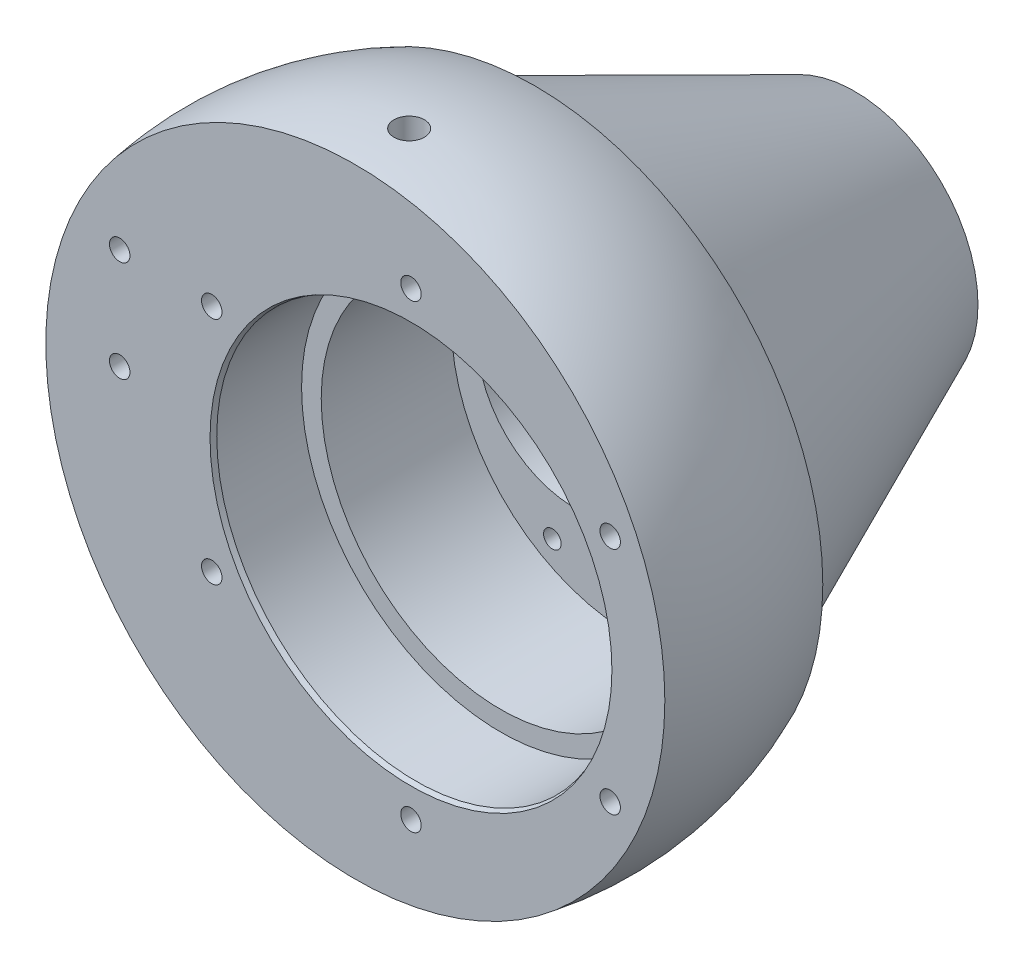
ISO-10303-21;
HEADER;
FILE_DESCRIPTION(('STEP AP214'),'2;1');
FILE_NAME('part.step','',(''),(''),'','','');
FILE_SCHEMA(('AUTOMOTIVE_DESIGN { 1 0 10303 214 1 1 1 1 }'));
ENDSEC;
DATA;
#1=APPLICATION_CONTEXT('core data for automotive mechanical design processes');
#2=APPLICATION_PROTOCOL_DEFINITION('international standard','automotive_design',2000,#1);
#3=PRODUCT_CONTEXT('',#1,'mechanical');
#4=PRODUCT('Part','Part','',(#3));
#5=PRODUCT_RELATED_PRODUCT_CATEGORY('part','',(#4));
#6=PRODUCT_DEFINITION_FORMATION('','',#4);
#7=PRODUCT_DEFINITION_CONTEXT('part definition',#1,'design');
#8=PRODUCT_DEFINITION('design','',#6,#7);
#9=PRODUCT_DEFINITION_SHAPE('','',#8);
#10=(LENGTH_UNIT() NAMED_UNIT(*) SI_UNIT(.MILLI.,.METRE.));
#11=(NAMED_UNIT(*) PLANE_ANGLE_UNIT() SI_UNIT($,.RADIAN.));
#12=(NAMED_UNIT(*) SI_UNIT($,.STERADIAN.) SOLID_ANGLE_UNIT());
#13=UNCERTAINTY_MEASURE_WITH_UNIT(LENGTH_MEASURE(1.E-05),#10,'distance_accuracy_value','');
#14=(GEOMETRIC_REPRESENTATION_CONTEXT(3) GLOBAL_UNCERTAINTY_ASSIGNED_CONTEXT((#13)) GLOBAL_UNIT_ASSIGNED_CONTEXT((#10,
#11,#12)) REPRESENTATION_CONTEXT('',''));
#15=CARTESIAN_POINT('',(0.,0.,0.));
#16=DIRECTION('',(0.,0.,1.));
#17=DIRECTION('',(1.,0.,0.));
#18=AXIS2_PLACEMENT_3D('',#15,#16,#17);
#19=CARTESIAN_POINT('',(15.748,0.,-62.23));
#20=DIRECTION('',(0.,0.,1.));
#21=DIRECTION('',(1.,0.,0.));
#22=AXIS2_PLACEMENT_3D('',#19,#20,#21);
#23=CYLINDRICAL_SURFACE('',#22,50.8);
#24=CARTESIAN_POINT('',(15.748,0.,-62.23));
#25=DIRECTION('',(0.,0.,1.));
#26=DIRECTION('',(1.,0.,0.));
#27=AXIS2_PLACEMENT_3D('',#24,#25,#26);
#28=CIRCLE('',#27,50.8);
#29=CARTESIAN_POINT('',(66.548,0.,-62.23));
#30=VERTEX_POINT('',#29);
#31=EDGE_CURVE('E200',#30,#30,#28,.T.);
#32=CARTESIAN_POINT('',(15.748,0.,-25.4));
#33=DIRECTION('',(0.,0.,1.));
#34=DIRECTION('',(1.,0.,0.));
#35=AXIS2_PLACEMENT_3D('',#32,#33,#34);
#36=CIRCLE('',#35,50.8);
#37=CARTESIAN_POINT('',(66.548,0.,-25.4));
#38=VERTEX_POINT('',#37);
#39=EDGE_CURVE('E174',#38,#38,#36,.T.);
#40=CARTESIAN_POINT('',(66.548,0.,-62.23));
#41=CARTESIAN_POINT('',(66.548,0.,-61.8463541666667));
#42=CARTESIAN_POINT('',(66.548,0.,-61.4627083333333));
#43=CARTESIAN_POINT('',(66.548,0.,-60.6954166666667));
#44=CARTESIAN_POINT('',(66.548,0.,-60.3117708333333));
#45=CARTESIAN_POINT('',(66.548,0.,-59.5444791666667));
#46=CARTESIAN_POINT('',(66.548,0.,-59.1608333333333));
#47=CARTESIAN_POINT('',(66.548,0.,-58.3935416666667));
#48=CARTESIAN_POINT('',(66.548,0.,-58.0098958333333));
#49=CARTESIAN_POINT('',(66.548,0.,-57.2426041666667));
#50=CARTESIAN_POINT('',(66.548,0.,-56.8589583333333));
#51=CARTESIAN_POINT('',(66.548,0.,-56.0916666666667));
#52=CARTESIAN_POINT('',(66.548,0.,-55.7080208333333));
#53=CARTESIAN_POINT('',(66.548,0.,-54.9407291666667));
#54=CARTESIAN_POINT('',(66.548,0.,-54.5570833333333));
#55=CARTESIAN_POINT('',(66.548,0.,-53.7897916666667));
#56=CARTESIAN_POINT('',(66.548,0.,-53.4061458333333));
#57=CARTESIAN_POINT('',(66.548,0.,-52.6388541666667));
#58=CARTESIAN_POINT('',(66.548,0.,-52.2552083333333));
#59=CARTESIAN_POINT('',(66.548,0.,-51.4879166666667));
#60=CARTESIAN_POINT('',(66.548,0.,-51.1042708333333));
#61=CARTESIAN_POINT('',(66.548,0.,-50.3369791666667));
#62=CARTESIAN_POINT('',(66.548,0.,-49.9533333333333));
#63=CARTESIAN_POINT('',(66.548,0.,-49.1860416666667));
#64=CARTESIAN_POINT('',(66.548,0.,-48.8023958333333));
#65=CARTESIAN_POINT('',(66.548,0.,-48.0351041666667));
#66=CARTESIAN_POINT('',(66.548,0.,-47.6514583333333));
#67=CARTESIAN_POINT('',(66.548,0.,-46.8841666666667));
#68=CARTESIAN_POINT('',(66.548,0.,-46.5005208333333));
#69=CARTESIAN_POINT('',(66.548,0.,-45.7332291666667));
#70=CARTESIAN_POINT('',(66.548,0.,-45.3495833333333));
#71=CARTESIAN_POINT('',(66.548,0.,-44.5822916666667));
#72=CARTESIAN_POINT('',(66.548,0.,-44.1986458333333));
#73=CARTESIAN_POINT('',(66.548,0.,-43.4313541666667));
#74=CARTESIAN_POINT('',(66.548,0.,-43.0477083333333));
#75=CARTESIAN_POINT('',(66.548,0.,-42.2804166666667));
#76=CARTESIAN_POINT('',(66.548,0.,-41.8967708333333));
#77=CARTESIAN_POINT('',(66.548,0.,-41.1294791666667));
#78=CARTESIAN_POINT('',(66.548,0.,-40.7458333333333));
#79=CARTESIAN_POINT('',(66.548,0.,-39.9785416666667));
#80=CARTESIAN_POINT('',(66.548,0.,-39.5948958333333));
#81=CARTESIAN_POINT('',(66.548,0.,-38.8276041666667));
#82=CARTESIAN_POINT('',(66.548,0.,-38.4439583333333));
#83=CARTESIAN_POINT('',(66.548,0.,-37.6766666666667));
#84=CARTESIAN_POINT('',(66.548,0.,-37.2930208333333));
#85=CARTESIAN_POINT('',(66.548,0.,-36.5257291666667));
#86=CARTESIAN_POINT('',(66.548,0.,-36.1420833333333));
#87=CARTESIAN_POINT('',(66.548,0.,-35.3747916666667));
#88=CARTESIAN_POINT('',(66.548,0.,-34.9911458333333));
#89=CARTESIAN_POINT('',(66.548,0.,-34.2238541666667));
#90=CARTESIAN_POINT('',(66.548,0.,-33.8402083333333));
#91=CARTESIAN_POINT('',(66.548,0.,-33.0729166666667));
#92=CARTESIAN_POINT('',(66.548,0.,-32.6892708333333));
#93=CARTESIAN_POINT('',(66.548,0.,-31.9219791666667));
#94=CARTESIAN_POINT('',(66.548,0.,-31.5383333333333));
#95=CARTESIAN_POINT('',(66.548,0.,-30.7710416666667));
#96=CARTESIAN_POINT('',(66.548,0.,-30.3873958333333));
#97=CARTESIAN_POINT('',(66.548,0.,-29.6201041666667));
#98=CARTESIAN_POINT('',(66.548,0.,-29.2364583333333));
#99=CARTESIAN_POINT('',(66.548,0.,-28.4691666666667));
#100=CARTESIAN_POINT('',(66.548,0.,-28.0855208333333));
#101=CARTESIAN_POINT('',(66.548,0.,-27.3182291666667));
#102=CARTESIAN_POINT('',(66.548,0.,-26.9345833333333));
#103=CARTESIAN_POINT('',(66.548,0.,-26.1672916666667));
#104=CARTESIAN_POINT('',(66.548,0.,-25.7836458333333));
#105=CARTESIAN_POINT('',(66.548,0.,-25.4));
#106=B_SPLINE_CURVE_WITH_KNOTS('',3,(#40,#41,#42,#43,#44,#45,#46,#47,#48,#49,#50,#51,#52,#53,
#54,#55,#56,#57,#58,#59,#60,#61,#62,#63,#64,#65,#66,#67,#68,#69,#70,#71,#72,#73,#74,#75,#76,#77,
#78,#79,#80,#81,#82,#83,#84,#85,#86,#87,#88,#89,#90,#91,#92,#93,#94,#95,#96,#97,#98,#99,#100,
#101,#102,#103,#104,#105),.UNSPECIFIED.,.F.,.F.,(4,2,2,2,2,2,2,2,2,2,2,2,2,2,2,2,2,2,2,2,2,2,2,
2,2,2,2,2,2,2,2,2,4),(0.,1.1509375,2.301875,3.4528125,4.60375,5.75468749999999,6.905625,
8.0565625,9.20749999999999,10.3584375,11.509375,12.6603125,13.81125,14.9621875,16.113125,
17.2640625,18.415,19.5659375,20.716875,21.8678125,23.01875,24.1696875,25.320625,26.4715625,
27.6225,28.7734375,29.924375,31.0753125,32.22625,33.3771875,34.528125,35.6790625,36.83),.UNSPECIFIED.);
#107=EDGE_CURVE('BSEAM32',#30,#38,#106,.T.);
#108=ORIENTED_EDGE('',*,*,#31,.F.);
#109=ORIENTED_EDGE('',*,*,#39,.T.);
#110=ORIENTED_EDGE('',*,*,#107,.T.);
#111=ORIENTED_EDGE('',*,*,#107,.F.);
#112=EDGE_LOOP('',(#108,#110,#109,#111));
#113=FACE_BOUND('',#112,.T.);
#114=ADVANCED_FACE('F32',(#113),#23,.F.);
#115=CARTESIAN_POINT('',(0.,0.,-15.24));
#116=DIRECTION('',(0.,0.,1.));
#117=DIRECTION('',(0.,1.,0.));
#118=AXIS2_PLACEMENT_3D('',#115,#116,#117);
#119=SPHERICAL_SURFACE('',#118,88.9);
#120=CARTESIAN_POINT('',(0.,0.,-50.8));
#121=DIRECTION('',(0.,0.,1.));
#122=DIRECTION('',(1.,0.,0.));
#123=AXIS2_PLACEMENT_3D('',#120,#121,#122);
#124=CIRCLE('',#123,81.4781958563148);
#125=CARTESIAN_POINT('',(81.4781958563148,0.,-50.8));
#126=VERTEX_POINT('',#125);
#127=EDGE_CURVE('E207',#126,#126,#124,.T.);
#128=ORIENTED_EDGE('',*,*,#127,.T.);
#129=EDGE_LOOP('',(#128));
#130=FACE_BOUND('',#129,.T.);
#131=CARTESIAN_POINT('',(0.,0.,0.));
#132=DIRECTION('',(0.,0.,1.));
#133=DIRECTION('',(1.,0.,0.));
#134=AXIS2_PLACEMENT_3D('',#131,#132,#133);
#135=CIRCLE('',#134,87.5839734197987);
#136=CARTESIAN_POINT('',(87.5839734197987,0.,0.));
#137=VERTEX_POINT('',#136);
#138=EDGE_CURVE('E204',#137,#137,#135,.T.);
#139=ORIENTED_EDGE('',*,*,#138,.F.);
#140=EDGE_LOOP('',(#139));
#141=FACE_BOUND('',#140,.T.);
#142=CARTESIAN_POINT('',(0.,88.7956890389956,-15.24));
#143=DIRECTION('',(0.,-1.,0.));
#144=DIRECTION('',(0.,0.,-1.));
#145=AXIS2_PLACEMENT_3D('',#142,#143,#144);
#146=CIRCLE('',#145,4.3053);
#147=CARTESIAN_POINT('',(0.,88.7956890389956,-10.9347));
#148=VERTEX_POINT('',#147);
#149=EDGE_CURVE('E187',#148,#148,#146,.T.);
#150=ORIENTED_EDGE('',*,*,#149,.T.);
#151=EDGE_LOOP('',(#150));
#152=FACE_BOUND('',#151,.T.);
#153=CARTESIAN_POINT('',(0.,-88.7956890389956,-15.24));
#154=DIRECTION('',(0.,1.,0.));
#155=DIRECTION('',(0.,0.,1.));
#156=AXIS2_PLACEMENT_3D('',#153,#154,#155);
#157=CIRCLE('',#156,4.3053);
#158=CARTESIAN_POINT('',(0.,-88.7956890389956,-19.5453));
#159=VERTEX_POINT('',#158);
#160=EDGE_CURVE('E183',#159,#159,#157,.F.);
#161=ORIENTED_EDGE('',*,*,#160,.F.);
#162=EDGE_LOOP('',(#161));
#163=FACE_BOUND('',#162,.T.);
#164=ADVANCED_FACE('F250',(#130,#141,#152,#163),#119,.T.);
#165=CARTESIAN_POINT('',(0.,0.,0.));
#166=DIRECTION('',(0.,0.,1.));
#167=DIRECTION('',(1.,0.,0.));
#168=AXIS2_PLACEMENT_3D('',#165,#166,#167);
#169=CYLINDRICAL_SURFACE('',#168,27.78125);
#170=CARTESIAN_POINT('',(0.,0.,-128.6002));
#171=DIRECTION('',(0.,0.,1.));
#172=DIRECTION('',(1.,0.,0.));
#173=AXIS2_PLACEMENT_3D('',#170,#171,#172);
#174=CIRCLE('',#173,27.78125);
#175=CARTESIAN_POINT('',(27.78125,0.,-128.6002));
#176=VERTEX_POINT('',#175);
#177=EDGE_CURVE('E213',#176,#176,#174,.T.);
#178=ORIENTED_EDGE('',*,*,#177,.F.);
#179=EDGE_LOOP('',(#178));
#180=FACE_BOUND('',#179,.T.);
#181=CARTESIAN_POINT('',(0.,0.,-62.23));
#182=DIRECTION('',(0.,0.,1.));
#183=DIRECTION('',(1.,0.,0.));
#184=AXIS2_PLACEMENT_3D('',#181,#182,#183);
#185=CIRCLE('',#184,27.78125);
#186=CARTESIAN_POINT('',(27.78125,0.,-62.23));
#187=VERTEX_POINT('',#186);
#188=EDGE_CURVE('E203',#187,#187,#185,.T.);
#189=ORIENTED_EDGE('',*,*,#188,.T.);
#190=EDGE_LOOP('',(#189));
#191=FACE_BOUND('',#190,.T.);
#192=ADVANCED_FACE('F34',(#180,#191),#169,.F.);
#193=CARTESIAN_POINT('',(0.,10.9982,-128.6002));
#194=DIRECTION('',(0.,0.,1.));
#195=DIRECTION('',(1.,0.,0.));
#196=AXIS2_PLACEMENT_3D('',#193,#194,#195);
#197=PLANE('',#196);
#198=CARTESIAN_POINT('',(0.,0.,-128.6002));
#199=DIRECTION('',(0.,0.,1.));
#200=DIRECTION('',(1.,0.,0.));
#201=AXIS2_PLACEMENT_3D('',#198,#199,#200);
#202=CIRCLE('',#201,20.675);
#203=CARTESIAN_POINT('',(20.675,0.,-128.6002));
#204=VERTEX_POINT('',#203);
#205=EDGE_CURVE('E104',#204,#204,#202,.T.);
#206=ORIENTED_EDGE('',*,*,#205,.F.);
#207=EDGE_LOOP('',(#206));
#208=FACE_BOUND('',#207,.T.);
#209=ORIENTED_EDGE('',*,*,#177,.T.);
#210=EDGE_LOOP('',(#209));
#211=FACE_BOUND('',#210,.T.);
#212=ADVANCED_FACE('F274',(#208,#211),#197,.T.);
#213=CARTESIAN_POINT('',(0.,0.,-151.5872));
#214=DIRECTION('',(0.,0.,1.));
#215=DIRECTION('',(1.,0.,0.));
#216=AXIS2_PLACEMENT_3D('',#213,#214,#215);
#217=CONICAL_SURFACE('',#216,30.31744,0.418822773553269);
#218=CARTESIAN_POINT('',(0.,0.,-141.3002));
#219=DIRECTION('',(0.,0.,1.));
#220=DIRECTION('',(1.,0.,0.));
#221=AXIS2_PLACEMENT_3D('',#218,#219,#220);
#222=CIRCLE('',#221,34.8968141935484);
#223=CARTESIAN_POINT('',(34.8968141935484,0.,-141.3002));
#224=VERTEX_POINT('',#223);
#225=EDGE_CURVE('E107',#224,#224,#222,.T.);
#226=ORIENTED_EDGE('',*,*,#225,.T.);
#227=EDGE_LOOP('',(#226));
#228=FACE_BOUND('',#227,.T.);
#229=CARTESIAN_POINT('',(0.,0.,-50.8));
#230=DIRECTION('',(0.,0.,1.));
#231=DIRECTION('',(1.,0.,0.));
#232=AXIS2_PLACEMENT_3D('',#229,#230,#231);
#233=CIRCLE('',#232,75.184);
#234=CARTESIAN_POINT('',(75.184,0.,-50.8));
#235=VERTEX_POINT('',#234);
#236=EDGE_CURVE('E210',#235,#235,#233,.T.);
#237=ORIENTED_EDGE('',*,*,#236,.F.);
#238=EDGE_LOOP('',(#237));
#239=FACE_BOUND('',#238,.T.);
#240=ADVANCED_FACE('F271',(#228,#239),#217,.T.);
#241=CARTESIAN_POINT('',(0.,75.184,-50.8));
#242=DIRECTION('',(0.,0.,1.));
#243=DIRECTION('',(1.,0.,0.));
#244=AXIS2_PLACEMENT_3D('',#241,#242,#243);
#245=PLANE('',#244);
#246=ORIENTED_EDGE('',*,*,#127,.F.);
#247=EDGE_LOOP('',(#246));
#248=FACE_BOUND('',#247,.T.);
#249=ORIENTED_EDGE('',*,*,#236,.T.);
#250=EDGE_LOOP('',(#249));
#251=FACE_BOUND('',#250,.T.);
#252=ADVANCED_FACE('F266',(#248,#251),#245,.F.);
#253=CARTESIAN_POINT('',(0.,27.78125,0.));
#254=DIRECTION('',(0.,0.,1.));
#255=DIRECTION('',(1.,0.,0.));
#256=AXIS2_PLACEMENT_3D('',#253,#254,#255);
#257=PLANE('',#256);
#258=CARTESIAN_POINT('',(72.1154284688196,32.5437500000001,0.));
#259=DIRECTION('',(0.,0.,1.));
#260=DIRECTION('',(1.,0.,0.));
#261=AXIS2_PLACEMENT_3D('',#258,#259,#260);
#262=CIRCLE('',#261,2.8956);
#263=CARTESIAN_POINT('',(75.0110284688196,32.5437500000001,0.));
#264=VERTEX_POINT('',#263);
#265=EDGE_CURVE('E138',#264,#264,#262,.T.);
#266=ORIENTED_EDGE('',*,*,#265,.F.);
#267=EDGE_LOOP('',(#266));
#268=FACE_BOUND('',#267,.T.);
#269=CARTESIAN_POINT('',(15.7479999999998,65.0875,0.));
#270=DIRECTION('',(0.,0.,1.));
#271=DIRECTION('',(1.,0.,0.));
#272=AXIS2_PLACEMENT_3D('',#269,#270,#271);
#273=CIRCLE('',#272,2.8956);
#274=CARTESIAN_POINT('',(18.6435999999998,65.0875,0.));
#275=VERTEX_POINT('',#274);
#276=EDGE_CURVE('E144',#275,#275,#273,.T.);
#277=ORIENTED_EDGE('',*,*,#276,.F.);
#278=EDGE_LOOP('',(#277));
#279=FACE_BOUND('',#278,.T.);
#280=CARTESIAN_POINT('',(-40.6194284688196,32.5437499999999,0.));
#281=DIRECTION('',(0.,0.,1.));
#282=DIRECTION('',(1.,0.,0.));
#283=AXIS2_PLACEMENT_3D('',#280,#281,#282);
#284=CIRCLE('',#283,2.8956);
#285=CARTESIAN_POINT('',(-37.7238284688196,32.5437499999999,0.));
#286=VERTEX_POINT('',#285);
#287=EDGE_CURVE('E150',#286,#286,#284,.T.);
#288=ORIENTED_EDGE('',*,*,#287,.F.);
#289=EDGE_LOOP('',(#288));
#290=FACE_BOUND('',#289,.T.);
#291=CARTESIAN_POINT('',(-40.6194284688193,-32.5437500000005,0.));
#292=DIRECTION('',(0.,0.,1.));
#293=DIRECTION('',(1.,0.,0.));
#294=AXIS2_PLACEMENT_3D('',#291,#292,#293);
#295=CIRCLE('',#294,2.8956);
#296=CARTESIAN_POINT('',(-37.7238284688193,-32.5437500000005,0.));
#297=VERTEX_POINT('',#296);
#298=EDGE_CURVE('E156',#297,#297,#295,.T.);
#299=ORIENTED_EDGE('',*,*,#298,.F.);
#300=EDGE_LOOP('',(#299));
#301=FACE_BOUND('',#300,.T.);
#302=CARTESIAN_POINT('',(15.7479999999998,-65.0875,0.));
#303=DIRECTION('',(0.,0.,1.));
#304=DIRECTION('',(1.,0.,0.));
#305=AXIS2_PLACEMENT_3D('',#302,#303,#304);
#306=CIRCLE('',#305,2.8956);
#307=CARTESIAN_POINT('',(18.6435999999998,-65.0875,0.));
#308=VERTEX_POINT('',#307);
#309=EDGE_CURVE('E162',#308,#308,#306,.T.);
#310=ORIENTED_EDGE('',*,*,#309,.F.);
#311=EDGE_LOOP('',(#310));
#312=FACE_BOUND('',#311,.T.);
#313=CARTESIAN_POINT('',(72.1154284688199,-32.5437499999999,0.));
#314=DIRECTION('',(0.,0.,1.));
#315=DIRECTION('',(1.,0.,0.));
#316=AXIS2_PLACEMENT_3D('',#313,#314,#315);
#317=CIRCLE('',#316,2.8956);
#318=CARTESIAN_POINT('',(75.0110284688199,-32.5437499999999,0.));
#319=VERTEX_POINT('',#318);
#320=EDGE_CURVE('E168',#319,#319,#317,.T.);
#321=ORIENTED_EDGE('',*,*,#320,.F.);
#322=EDGE_LOOP('',(#321));
#323=FACE_BOUND('',#322,.T.);
#324=CARTESIAN_POINT('',(15.748,0.,0.));
#325=DIRECTION('',(0.,0.,1.));
#326=DIRECTION('',(1.,0.,0.));
#327=AXIS2_PLACEMENT_3D('',#324,#325,#326);
#328=CIRCLE('',#327,56.8642754);
#329=CARTESIAN_POINT('',(72.6122754,0.,0.));
#330=VERTEX_POINT('',#329);
#331=EDGE_CURVE('E225',#330,#330,#328,.F.);
#332=ORIENTED_EDGE('',*,*,#331,.T.);
#333=EDGE_LOOP('',(#332));
#334=FACE_BOUND('',#333,.T.);
#335=CARTESIAN_POINT('',(-66.675,4.7625,0.));
#336=DIRECTION('',(0.,0.,1.));
#337=DIRECTION('',(-1.,0.,0.));
#338=AXIS2_PLACEMENT_3D('',#335,#336,#337);
#339=CIRCLE('',#338,2.89559999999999);
#340=CARTESIAN_POINT('',(-69.5706,4.7625,0.));
#341=VERTEX_POINT('',#340);
#342=EDGE_CURVE('E188',#341,#341,#339,.T.);
#343=ORIENTED_EDGE('',*,*,#342,.F.);
#344=EDGE_LOOP('',(#343));
#345=FACE_BOUND('',#344,.T.);
#346=CARTESIAN_POINT('',(-66.675,33.3375,0.));
#347=DIRECTION('',(0.,0.,1.));
#348=DIRECTION('',(-1.,0.,0.));
#349=AXIS2_PLACEMENT_3D('',#346,#347,#348);
#350=CIRCLE('',#349,2.8956);
#351=CARTESIAN_POINT('',(-69.5706,33.3375,0.));
#352=VERTEX_POINT('',#351);
#353=EDGE_CURVE('E194',#352,#352,#350,.T.);
#354=ORIENTED_EDGE('',*,*,#353,.F.);
#355=EDGE_LOOP('',(#354));
#356=FACE_BOUND('',#355,.T.);
#357=ORIENTED_EDGE('',*,*,#138,.T.);
#358=EDGE_LOOP('',(#357));
#359=FACE_BOUND('',#358,.T.);
#360=ADVANCED_FACE('F264',(#268,#279,#290,#301,#312,#323,#334,#345,#356,#359),#257,.T.);
#361=CARTESIAN_POINT('',(15.748,0.,-62.23));
#362=DIRECTION('',(0.,0.,1.));
#363=DIRECTION('',(1.,0.,0.));
#364=AXIS2_PLACEMENT_3D('',#361,#362,#363);
#365=PLANE('',#364);
#366=CARTESIAN_POINT('',(37.9729999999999,38.4948291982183,-62.23));
#367=DIRECTION('',(0.,0.,1.));
#368=DIRECTION('',(-1.,0.,0.));
#369=AXIS2_PLACEMENT_3D('',#366,#367,#368);
#370=CIRCLE('',#369,2.4892);
#371=CARTESIAN_POINT('',(35.4837999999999,38.4948291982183,-62.23));
#372=VERTEX_POINT('',#371);
#373=EDGE_CURVE('E108',#372,#372,#370,.T.);
#374=ORIENTED_EDGE('',*,*,#373,.F.);
#375=EDGE_LOOP('',(#374));
#376=FACE_BOUND('',#375,.T.);
#377=CARTESIAN_POINT('',(-6.47699999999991,38.4948291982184,-62.23));
#378=DIRECTION('',(0.,0.,1.));
#379=DIRECTION('',(1.,0.,0.));
#380=AXIS2_PLACEMENT_3D('',#377,#378,#379);
#381=CIRCLE('',#380,2.4892);
#382=CARTESIAN_POINT('',(-3.98779999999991,38.4948291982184,-62.23));
#383=VERTEX_POINT('',#382);
#384=EDGE_CURVE('E114',#383,#383,#381,.T.);
#385=ORIENTED_EDGE('',*,*,#384,.F.);
#386=EDGE_LOOP('',(#385));
#387=FACE_BOUND('',#386,.T.);
#388=CARTESIAN_POINT('',(60.1979999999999,2.94867472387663E-13,-62.23));
#389=DIRECTION('',(0.,0.,1.));
#390=DIRECTION('',(1.,0.,0.));
#391=AXIS2_PLACEMENT_3D('',#388,#389,#390);
#392=CIRCLE('',#391,2.4892);
#393=CARTESIAN_POINT('',(62.6871999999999,2.94867472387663E-13,-62.23));
#394=VERTEX_POINT('',#393);
#395=EDGE_CURVE('E120',#394,#394,#392,.T.);
#396=ORIENTED_EDGE('',*,*,#395,.F.);
#397=EDGE_LOOP('',(#396));
#398=FACE_BOUND('',#397,.T.);
#399=CARTESIAN_POINT('',(-6.47699999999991,-38.4948291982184,-62.23));
#400=DIRECTION('',(0.,0.,1.));
#401=DIRECTION('',(1.,0.,0.));
#402=AXIS2_PLACEMENT_3D('',#399,#400,#401);
#403=CIRCLE('',#402,2.4892);
#404=CARTESIAN_POINT('',(-3.98779999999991,-38.4948291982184,-62.23));
#405=VERTEX_POINT('',#404);
#406=EDGE_CURVE('E126',#405,#405,#403,.T.);
#407=ORIENTED_EDGE('',*,*,#406,.F.);
#408=EDGE_LOOP('',(#407));
#409=FACE_BOUND('',#408,.T.);
#410=CARTESIAN_POINT('',(37.9729999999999,-38.4948291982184,-62.23));
#411=DIRECTION('',(0.,0.,1.));
#412=DIRECTION('',(-1.,0.,0.));
#413=AXIS2_PLACEMENT_3D('',#410,#411,#412);
#414=CIRCLE('',#413,2.4892);
#415=CARTESIAN_POINT('',(35.4837999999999,-38.4948291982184,-62.23));
#416=VERTEX_POINT('',#415);
#417=EDGE_CURVE('E132',#416,#416,#414,.T.);
#418=ORIENTED_EDGE('',*,*,#417,.F.);
#419=EDGE_LOOP('',(#418));
#420=FACE_BOUND('',#419,.T.);
#421=ORIENTED_EDGE('',*,*,#188,.F.);
#422=EDGE_LOOP('',(#421));
#423=FACE_BOUND('',#422,.T.);
#424=ORIENTED_EDGE('',*,*,#31,.T.);
#425=EDGE_LOOP('',(#424));
#426=FACE_BOUND('',#425,.T.);
#427=ADVANCED_FACE('F262',(#376,#387,#398,#409,#420,#423,#426),#365,.T.);
#428=CARTESIAN_POINT('',(-66.675,33.3375,-10.16));
#429=DIRECTION('',(0.,0.,1.));
#430=DIRECTION('',(1.,0.,0.));
#431=AXIS2_PLACEMENT_3D('',#428,#429,#430);
#432=CYLINDRICAL_SURFACE('',#431,2.8956);
#433=CARTESIAN_POINT('',(-66.675,33.3375,-10.16));
#434=DIRECTION('',(0.,0.,1.));
#435=DIRECTION('',(-1.,0.,0.));
#436=AXIS2_PLACEMENT_3D('',#433,#434,#435);
#437=CIRCLE('',#436,2.8956);
#438=CARTESIAN_POINT('',(-69.5706,33.3375,-10.16));
#439=VERTEX_POINT('',#438);
#440=EDGE_CURVE('E197',#439,#439,#437,.T.);
#441=ORIENTED_EDGE('',*,*,#440,.F.);
#442=EDGE_LOOP('',(#441));
#443=FACE_BOUND('',#442,.T.);
#444=ORIENTED_EDGE('',*,*,#353,.T.);
#445=EDGE_LOOP('',(#444));
#446=FACE_BOUND('',#445,.T.);
#447=ADVANCED_FACE('F290',(#443,#446),#432,.F.);
#448=CARTESIAN_POINT('',(-66.675,33.3375,-10.16));
#449=DIRECTION('',(0.,0.,-1.));
#450=DIRECTION('',(-1.,0.,0.));
#451=AXIS2_PLACEMENT_3D('',#448,#449,#450);
#452=PLANE('',#451);
#453=ORIENTED_EDGE('',*,*,#440,.T.);
#454=EDGE_LOOP('',(#453));
#455=FACE_BOUND('',#454,.T.);
#456=ADVANCED_FACE('F295',(#455),#452,.F.);
#457=CARTESIAN_POINT('',(-66.675,4.7625,-10.16));
#458=DIRECTION('',(0.,0.,1.));
#459=DIRECTION('',(1.,0.,0.));
#460=AXIS2_PLACEMENT_3D('',#457,#458,#459);
#461=CYLINDRICAL_SURFACE('',#460,2.89559999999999);
#462=CARTESIAN_POINT('',(-66.675,4.7625,-10.16));
#463=DIRECTION('',(0.,0.,1.));
#464=DIRECTION('',(-1.,0.,0.));
#465=AXIS2_PLACEMENT_3D('',#462,#463,#464);
#466=CIRCLE('',#465,2.89559999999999);
#467=CARTESIAN_POINT('',(-69.5706,4.7625,-10.16));
#468=VERTEX_POINT('',#467);
#469=EDGE_CURVE('E191',#468,#468,#466,.T.);
#470=ORIENTED_EDGE('',*,*,#469,.F.);
#471=EDGE_LOOP('',(#470));
#472=FACE_BOUND('',#471,.T.);
#473=ORIENTED_EDGE('',*,*,#342,.T.);
#474=EDGE_LOOP('',(#473));
#475=FACE_BOUND('',#474,.T.);
#476=ADVANCED_FACE('F400',(#472,#475),#461,.F.);
#477=CARTESIAN_POINT('',(-66.675,4.7625,-10.16));
#478=DIRECTION('',(0.,0.,-1.));
#479=DIRECTION('',(-1.,0.,0.));
#480=AXIS2_PLACEMENT_3D('',#477,#478,#479);
#481=PLANE('',#480);
#482=ORIENTED_EDGE('',*,*,#469,.T.);
#483=EDGE_LOOP('',(#482));
#484=FACE_BOUND('',#483,.T.);
#485=ADVANCED_FACE('F396',(#484),#481,.F.);
#486=CARTESIAN_POINT('',(0.,73.66,-15.24));
#487=DIRECTION('',(0.,1.,0.));
#488=DIRECTION('',(0.,0.,1.));
#489=AXIS2_PLACEMENT_3D('',#486,#487,#488);
#490=CYLINDRICAL_SURFACE('',#489,4.3053);
#491=CARTESIAN_POINT('',(0.,73.66,-15.24));
#492=DIRECTION('',(0.,1.,0.));
#493=DIRECTION('',(0.,0.,1.));
#494=AXIS2_PLACEMENT_3D('',#491,#492,#493);
#495=CIRCLE('',#494,4.3053);
#496=CARTESIAN_POINT('',(0.,73.66,-10.9347));
#497=VERTEX_POINT('',#496);
#498=EDGE_CURVE('E184',#497,#497,#495,.T.);
#499=CARTESIAN_POINT('',(0.,73.66,-10.9347));
#500=CARTESIAN_POINT('',(0.,73.8176634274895,-10.9347));
#501=CARTESIAN_POINT('',(0.,73.9753268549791,-10.9347));
#502=CARTESIAN_POINT('',(0.,74.2906537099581,-10.9347));
#503=CARTESIAN_POINT('',(0.,74.4483171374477,-10.9347));
#504=CARTESIAN_POINT('',(0.,74.7636439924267,-10.9347));
#505=CARTESIAN_POINT('',(0.,74.9213074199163,-10.9347));
#506=CARTESIAN_POINT('',(0.,75.2366342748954,-10.9347));
#507=CARTESIAN_POINT('',(0.,75.3942977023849,-10.9347));
#508=CARTESIAN_POINT('',(0.,75.709624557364,-10.9347));
#509=CARTESIAN_POINT('',(0.,75.8672879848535,-10.9347));
#510=CARTESIAN_POINT('',(0.,76.1826148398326,-10.9347));
#511=CARTESIAN_POINT('',(0.,76.3402782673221,-10.9347));
#512=CARTESIAN_POINT('',(0.,76.6556051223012,-10.9347));
#513=CARTESIAN_POINT('',(0.,76.8132685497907,-10.9347));
#514=CARTESIAN_POINT('',(0.,77.1285954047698,-10.9347));
#515=CARTESIAN_POINT('',(0.,77.2862588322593,-10.9347));
#516=CARTESIAN_POINT('',(0.,77.6015856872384,-10.9347));
#517=CARTESIAN_POINT('',(0.,77.759249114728,-10.9347));
#518=CARTESIAN_POINT('',(0.,78.074575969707,-10.9347));
#519=CARTESIAN_POINT('',(0.,78.2322393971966,-10.9347));
#520=CARTESIAN_POINT('',(0.,78.5475662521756,-10.9347));
#521=CARTESIAN_POINT('',(0.,78.7052296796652,-10.9347));
#522=CARTESIAN_POINT('',(0.,79.0205565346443,-10.9347));
#523=CARTESIAN_POINT('',(0.,79.1782199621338,-10.9347));
#524=CARTESIAN_POINT('',(0.,79.4935468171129,-10.9347));
#525=CARTESIAN_POINT('',(0.,79.6512102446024,-10.9347));
#526=CARTESIAN_POINT('',(0.,79.9665370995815,-10.9347));
#527=CARTESIAN_POINT('',(0.,80.124200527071,-10.9347));
#528=CARTESIAN_POINT('',(0.,80.4395273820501,-10.9347));
#529=CARTESIAN_POINT('',(0.,80.5971908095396,-10.9347));
#530=CARTESIAN_POINT('',(0.,80.9125176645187,-10.9347));
#531=CARTESIAN_POINT('',(0.,81.0701810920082,-10.9347));
#532=CARTESIAN_POINT('',(0.,81.3855079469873,-10.9347));
#533=CARTESIAN_POINT('',(0.,81.5431713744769,-10.9347));
#534=CARTESIAN_POINT('',(0.,81.8584982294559,-10.9347));
#535=CARTESIAN_POINT('',(0.,82.0161616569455,-10.9347));
#536=CARTESIAN_POINT('',(0.,82.3314885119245,-10.9347));
#537=CARTESIAN_POINT('',(0.,82.4891519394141,-10.9347));
#538=CARTESIAN_POINT('',(0.,82.8044787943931,-10.9347));
#539=CARTESIAN_POINT('',(0.,82.9621422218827,-10.9347));
#540=CARTESIAN_POINT('',(0.,83.2774690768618,-10.9347));
#541=CARTESIAN_POINT('',(0.,83.4351325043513,-10.9347));
#542=CARTESIAN_POINT('',(0.,83.7504593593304,-10.9347));
#543=CARTESIAN_POINT('',(0.,83.9081227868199,-10.9347));
#544=CARTESIAN_POINT('',(0.,84.223449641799,-10.9347));
#545=CARTESIAN_POINT('',(0.,84.3811130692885,-10.9347));
#546=CARTESIAN_POINT('',(0.,84.6964399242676,-10.9347));
#547=CARTESIAN_POINT('',(0.,84.8541033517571,-10.9347));
#548=CARTESIAN_POINT('',(0.,85.1694302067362,-10.9347));
#549=CARTESIAN_POINT('',(0.,85.3270936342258,-10.9347));
#550=CARTESIAN_POINT('',(0.,85.6424204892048,-10.9347));
#551=CARTESIAN_POINT('',(0.,85.8000839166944,-10.9347));
#552=CARTESIAN_POINT('',(0.,86.1154107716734,-10.9347));
#553=CARTESIAN_POINT('',(0.,86.273074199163,-10.9347));
#554=CARTESIAN_POINT('',(0.,86.5884010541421,-10.9347));
#555=CARTESIAN_POINT('',(0.,86.7460644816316,-10.9347));
#556=CARTESIAN_POINT('',(0.,87.0613913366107,-10.9347));
#557=CARTESIAN_POINT('',(0.,87.2190547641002,-10.9347));
#558=CARTESIAN_POINT('',(0.,87.5343816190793,-10.9347));
#559=CARTESIAN_POINT('',(0.,87.6920450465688,-10.9347));
#560=CARTESIAN_POINT('',(0.,88.0073719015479,-10.9347));
#561=CARTESIAN_POINT('',(0.,88.1650353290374,-10.9347));
#562=CARTESIAN_POINT('',(0.,88.4803621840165,-10.9347));
#563=CARTESIAN_POINT('',(0.,88.638025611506,-10.9347));
#564=CARTESIAN_POINT('',(0.,88.7956890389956,-10.9347));
#565=B_SPLINE_CURVE_WITH_KNOTS('',3,(#499,#500,#501,#502,#503,#504,#505,#506,#507,#508,#509,
#510,#511,#512,#513,#514,#515,#516,#517,#518,#519,#520,#521,#522,#523,#524,#525,#526,#527,#528,
#529,#530,#531,#532,#533,#534,#535,#536,#537,#538,#539,#540,#541,#542,#543,#544,#545,#546,#547,
#548,#549,#550,#551,#552,#553,#554,#555,#556,#557,#558,#559,#560,#561,#562,#563,#564),
.UNSPECIFIED.,.F.,.F.,(4,2,2,2,2,2,2,2,2,2,2,2,2,2,2,2,2,2,2,2,2,2,2,2,2,2,2,2,2,2,2,2,4),(0.,
0.472990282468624,0.945980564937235,1.41897084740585,1.89196112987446,2.36495141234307,
2.83794169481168,3.31093197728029,3.78392225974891,4.25691254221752,4.72990282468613,
5.20289310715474,5.67588338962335,6.14887367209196,6.62186395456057,7.09485423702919,
7.56784451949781,8.04083480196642,8.51382508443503,8.98681536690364,9.45980564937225,
9.93279593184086,10.4057862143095,10.8787764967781,11.3517667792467,11.8247570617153,
12.2977473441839,12.7707376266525,13.2437279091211,13.7167181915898,14.1897084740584,
14.662698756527,15.1356890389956),.UNSPECIFIED.);
#566=EDGE_CURVE('BSEAM392',#497,#148,#565,.T.);
#567=ORIENTED_EDGE('',*,*,#498,.F.);
#568=ORIENTED_EDGE('',*,*,#149,.F.);
#569=ORIENTED_EDGE('',*,*,#566,.T.);
#570=ORIENTED_EDGE('',*,*,#566,.F.);
#571=EDGE_LOOP('',(#567,#569,#568,#570));
#572=FACE_BOUND('',#571,.T.);
#573=ADVANCED_FACE('F392',(#572),#490,.F.);
#574=CARTESIAN_POINT('',(0.,73.66,-15.24));
#575=DIRECTION('',(0.,1.,0.));
#576=DIRECTION('',(0.,0.,1.));
#577=AXIS2_PLACEMENT_3D('',#574,#575,#576);
#578=PLANE('',#577);
#579=ORIENTED_EDGE('',*,*,#498,.T.);
#580=EDGE_LOOP('',(#579));
#581=FACE_BOUND('',#580,.T.);
#582=ADVANCED_FACE('F388',(#581),#578,.T.);
#583=CARTESIAN_POINT('',(0.,-73.66,-15.24));
#584=DIRECTION('',(0.,-1.,0.));
#585=DIRECTION('',(0.,0.,-1.));
#586=AXIS2_PLACEMENT_3D('',#583,#584,#585);
#587=CYLINDRICAL_SURFACE('',#586,4.3053);
#588=CARTESIAN_POINT('',(0.,-73.66,-15.24));
#589=DIRECTION('',(0.,1.,0.));
#590=DIRECTION('',(0.,0.,1.));
#591=AXIS2_PLACEMENT_3D('',#588,#589,#590);
#592=CIRCLE('',#591,4.3053);
#593=CARTESIAN_POINT('',(0.,-73.66,-19.5453));
#594=VERTEX_POINT('',#593);
#595=EDGE_CURVE('E180',#594,#594,#592,.T.);
#596=CARTESIAN_POINT('',(0.,-73.66,-19.5453));
#597=CARTESIAN_POINT('',(0.,-73.8176634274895,-19.5453));
#598=CARTESIAN_POINT('',(0.,-73.9753268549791,-19.5453));
#599=CARTESIAN_POINT('',(0.,-74.2906537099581,-19.5453));
#600=CARTESIAN_POINT('',(0.,-74.4483171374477,-19.5453));
#601=CARTESIAN_POINT('',(0.,-74.7636439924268,-19.5453));
#602=CARTESIAN_POINT('',(0.,-74.9213074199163,-19.5453));
#603=CARTESIAN_POINT('',(0.,-75.2366342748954,-19.5453));
#604=CARTESIAN_POINT('',(0.,-75.3942977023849,-19.5453));
#605=CARTESIAN_POINT('',(0.,-75.709624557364,-19.5453));
#606=CARTESIAN_POINT('',(0.,-75.8672879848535,-19.5453));
#607=CARTESIAN_POINT('',(0.,-76.1826148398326,-19.5453));
#608=CARTESIAN_POINT('',(0.,-76.3402782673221,-19.5453));
#609=CARTESIAN_POINT('',(0.,-76.6556051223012,-19.5453));
#610=CARTESIAN_POINT('',(0.,-76.8132685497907,-19.5453));
#611=CARTESIAN_POINT('',(0.,-77.1285954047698,-19.5453));
#612=CARTESIAN_POINT('',(0.,-77.2862588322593,-19.5453));
#613=CARTESIAN_POINT('',(0.,-77.6015856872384,-19.5453));
#614=CARTESIAN_POINT('',(0.,-77.759249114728,-19.5453));
#615=CARTESIAN_POINT('',(0.,-78.074575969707,-19.5453));
#616=CARTESIAN_POINT('',(0.,-78.2322393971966,-19.5453));
#617=CARTESIAN_POINT('',(0.,-78.5475662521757,-19.5453));
#618=CARTESIAN_POINT('',(0.,-78.7052296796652,-19.5453));
#619=CARTESIAN_POINT('',(0.,-79.0205565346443,-19.5453));
#620=CARTESIAN_POINT('',(0.,-79.1782199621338,-19.5453));
#621=CARTESIAN_POINT('',(0.,-79.4935468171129,-19.5453));
#622=CARTESIAN_POINT('',(0.,-79.6512102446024,-19.5453));
#623=CARTESIAN_POINT('',(0.,-79.9665370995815,-19.5453));
#624=CARTESIAN_POINT('',(0.,-80.124200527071,-19.5453));
#625=CARTESIAN_POINT('',(0.,-80.4395273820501,-19.5453));
#626=CARTESIAN_POINT('',(0.,-80.5971908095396,-19.5453));
#627=CARTESIAN_POINT('',(0.,-80.9125176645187,-19.5453));
#628=CARTESIAN_POINT('',(0.,-81.0701810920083,-19.5453));
#629=CARTESIAN_POINT('',(0.,-81.3855079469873,-19.5453));
#630=CARTESIAN_POINT('',(0.,-81.5431713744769,-19.5453));
#631=CARTESIAN_POINT('',(0.,-81.8584982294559,-19.5453));
#632=CARTESIAN_POINT('',(0.,-82.0161616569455,-19.5453));
#633=CARTESIAN_POINT('',(0.,-82.3314885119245,-19.5453));
#634=CARTESIAN_POINT('',(0.,-82.4891519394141,-19.5453));
#635=CARTESIAN_POINT('',(0.,-82.8044787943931,-19.5453));
#636=CARTESIAN_POINT('',(0.,-82.9621422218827,-19.5453));
#637=CARTESIAN_POINT('',(0.,-83.2774690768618,-19.5453));
#638=CARTESIAN_POINT('',(0.,-83.4351325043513,-19.5453));
#639=CARTESIAN_POINT('',(0.,-83.7504593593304,-19.5453));
#640=CARTESIAN_POINT('',(0.,-83.9081227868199,-19.5453));
#641=CARTESIAN_POINT('',(0.,-84.223449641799,-19.5453));
#642=CARTESIAN_POINT('',(0.,-84.3811130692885,-19.5453));
#643=CARTESIAN_POINT('',(0.,-84.6964399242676,-19.5453));
#644=CARTESIAN_POINT('',(0.,-84.8541033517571,-19.5453));
#645=CARTESIAN_POINT('',(0.,-85.1694302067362,-19.5453));
#646=CARTESIAN_POINT('',(0.,-85.3270936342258,-19.5453));
#647=CARTESIAN_POINT('',(0.,-85.6424204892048,-19.5453));
#648=CARTESIAN_POINT('',(0.,-85.8000839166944,-19.5453));
#649=CARTESIAN_POINT('',(0.,-86.1154107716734,-19.5453));
#650=CARTESIAN_POINT('',(0.,-86.273074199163,-19.5453));
#651=CARTESIAN_POINT('',(0.,-86.5884010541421,-19.5453));
#652=CARTESIAN_POINT('',(0.,-86.7460644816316,-19.5453));
#653=CARTESIAN_POINT('',(0.,-87.0613913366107,-19.5453));
#654=CARTESIAN_POINT('',(0.,-87.2190547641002,-19.5453));
#655=CARTESIAN_POINT('',(0.,-87.5343816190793,-19.5453));
#656=CARTESIAN_POINT('',(0.,-87.6920450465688,-19.5453));
#657=CARTESIAN_POINT('',(0.,-88.0073719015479,-19.5453));
#658=CARTESIAN_POINT('',(0.,-88.1650353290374,-19.5453));
#659=CARTESIAN_POINT('',(0.,-88.4803621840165,-19.5453));
#660=CARTESIAN_POINT('',(0.,-88.638025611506,-19.5453));
#661=CARTESIAN_POINT('',(0.,-88.7956890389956,-19.5453));
#662=B_SPLINE_CURVE_WITH_KNOTS('',3,(#596,#597,#598,#599,#600,#601,#602,#603,#604,#605,#606,
#607,#608,#609,#610,#611,#612,#613,#614,#615,#616,#617,#618,#619,#620,#621,#622,#623,#624,#625,
#626,#627,#628,#629,#630,#631,#632,#633,#634,#635,#636,#637,#638,#639,#640,#641,#642,#643,#644,
#645,#646,#647,#648,#649,#650,#651,#652,#653,#654,#655,#656,#657,#658,#659,#660,#661),
.UNSPECIFIED.,.F.,.F.,(4,2,2,2,2,2,2,2,2,2,2,2,2,2,2,2,2,2,2,2,2,2,2,2,2,2,2,2,2,2,2,2,4),(0.,
0.472990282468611,0.945980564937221,1.41897084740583,1.89196112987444,2.36495141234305,
2.83794169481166,3.31093197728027,3.78392225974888,4.25691254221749,4.72990282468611,
5.20289310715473,5.67588338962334,6.14887367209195,6.62186395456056,7.09485423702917,
7.56784451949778,8.04083480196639,8.513825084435,8.98681536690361,9.45980564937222,
9.93279593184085,10.4057862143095,10.8787764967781,11.3517667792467,11.8247570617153,
12.2977473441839,12.7707376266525,13.2437279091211,13.7167181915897,14.1897084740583,
14.662698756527,15.1356890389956),.UNSPECIFIED.);
#663=EDGE_CURVE('BSEAM384',#594,#159,#662,.T.);
#664=ORIENTED_EDGE('',*,*,#595,.T.);
#665=ORIENTED_EDGE('',*,*,#160,.T.);
#666=ORIENTED_EDGE('',*,*,#663,.T.);
#667=ORIENTED_EDGE('',*,*,#663,.F.);
#668=EDGE_LOOP('',(#664,#666,#665,#667));
#669=FACE_BOUND('',#668,.T.);
#670=ADVANCED_FACE('F384',(#669),#587,.F.);
#671=CARTESIAN_POINT('',(0.,-73.66,-15.24));
#672=DIRECTION('',(0.,-1.,0.));
#673=DIRECTION('',(0.,0.,1.));
#674=AXIS2_PLACEMENT_3D('',#671,#672,#673);
#675=PLANE('',#674);
#676=ORIENTED_EDGE('',*,*,#595,.F.);
#677=EDGE_LOOP('',(#676));
#678=FACE_BOUND('',#677,.T.);
#679=ADVANCED_FACE('F380',(#678),#675,.T.);
#680=CARTESIAN_POINT('',(15.748,0.,-25.4));
#681=DIRECTION('',(0.,0.,1.));
#682=DIRECTION('',(1.,0.,0.));
#683=AXIS2_PLACEMENT_3D('',#680,#681,#682);
#684=CYLINDRICAL_SURFACE('',#683,56.3562754);
#685=CARTESIAN_POINT('',(15.748,0.,-1.39571852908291));
#686=DIRECTION('',(0.,0.,1.));
#687=DIRECTION('',(1.,0.,0.));
#688=AXIS2_PLACEMENT_3D('',#685,#686,#687);
#689=CIRCLE('',#688,56.3562754);
#690=CARTESIAN_POINT('',(72.1042754,0.,-1.39571852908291));
#691=VERTEX_POINT('',#690);
#692=EDGE_CURVE('E216',#691,#691,#689,.T.);
#693=ORIENTED_EDGE('',*,*,#692,.T.);
#694=EDGE_LOOP('',(#693));
#695=FACE_BOUND('',#694,.T.);
#696=CARTESIAN_POINT('',(15.748,0.,-25.4));
#697=DIRECTION('',(0.,0.,1.));
#698=DIRECTION('',(1.,0.,0.));
#699=AXIS2_PLACEMENT_3D('',#696,#697,#698);
#700=CIRCLE('',#699,56.3562754);
#701=CARTESIAN_POINT('',(72.1042754,0.,-25.4));
#702=VERTEX_POINT('',#701);
#703=EDGE_CURVE('E177',#702,#702,#700,.T.);
#704=ORIENTED_EDGE('',*,*,#703,.F.);
#705=EDGE_LOOP('',(#704));
#706=FACE_BOUND('',#705,.T.);
#707=ADVANCED_FACE('F376',(#695,#706),#684,.F.);
#708=CARTESIAN_POINT('',(15.748,0.,-25.4));
#709=DIRECTION('',(0.,0.,1.));
#710=DIRECTION('',(1.,0.,0.));
#711=AXIS2_PLACEMENT_3D('',#708,#709,#710);
#712=PLANE('',#711);
#713=ORIENTED_EDGE('',*,*,#39,.F.);
#714=EDGE_LOOP('',(#713));
#715=FACE_BOUND('',#714,.T.);
#716=ORIENTED_EDGE('',*,*,#703,.T.);
#717=EDGE_LOOP('',(#716));
#718=FACE_BOUND('',#717,.T.);
#719=ADVANCED_FACE('F372',(#715,#718),#712,.T.);
#720=CARTESIAN_POINT('',(15.748,0.,-1.39571852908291));
#721=DIRECTION('',(0.,0.,1.));
#722=DIRECTION('',(1.,0.,0.));
#723=AXIS2_PLACEMENT_3D('',#720,#721,#722);
#724=CONICAL_SURFACE('',#723,56.3562754,0.349065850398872);
#725=ORIENTED_EDGE('',*,*,#331,.F.);
#726=EDGE_LOOP('',(#725));
#727=FACE_BOUND('',#726,.T.);
#728=ORIENTED_EDGE('',*,*,#692,.F.);
#729=EDGE_LOOP('',(#728));
#730=FACE_BOUND('',#729,.T.);
#731=ADVANCED_FACE('F368',(#727,#730),#724,.F.);
#732=CARTESIAN_POINT('',(72.1154284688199,-32.5437499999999,-10.16));
#733=DIRECTION('',(0.,0.,1.));
#734=DIRECTION('',(1.,0.,0.));
#735=AXIS2_PLACEMENT_3D('',#732,#733,#734);
#736=CYLINDRICAL_SURFACE('',#735,2.8956);
#737=CARTESIAN_POINT('',(72.1154284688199,-32.5437499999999,-10.16));
#738=DIRECTION('',(0.,0.,1.));
#739=DIRECTION('',(1.,0.,0.));
#740=AXIS2_PLACEMENT_3D('',#737,#738,#739);
#741=CIRCLE('',#740,2.8956);
#742=CARTESIAN_POINT('',(75.0110284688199,-32.5437499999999,-10.16));
#743=VERTEX_POINT('',#742);
#744=EDGE_CURVE('E171',#743,#743,#741,.T.);
#745=ORIENTED_EDGE('',*,*,#744,.F.);
#746=EDGE_LOOP('',(#745));
#747=FACE_BOUND('',#746,.T.);
#748=ORIENTED_EDGE('',*,*,#320,.T.);
#749=EDGE_LOOP('',(#748));
#750=FACE_BOUND('',#749,.T.);
#751=ADVANCED_FACE('F364',(#747,#750),#736,.F.);
#752=CARTESIAN_POINT('',(72.1154284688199,-32.5437499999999,-10.16));
#753=DIRECTION('',(0.,0.,1.));
#754=DIRECTION('',(1.,0.,0.));
#755=AXIS2_PLACEMENT_3D('',#752,#753,#754);
#756=PLANE('',#755);
#757=ORIENTED_EDGE('',*,*,#744,.T.);
#758=EDGE_LOOP('',(#757));
#759=FACE_BOUND('',#758,.T.);
#760=ADVANCED_FACE('F360',(#759),#756,.T.);
#761=CARTESIAN_POINT('',(15.7479999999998,-65.0875,-10.16));
#762=DIRECTION('',(0.,0.,1.));
#763=DIRECTION('',(1.,0.,0.));
#764=AXIS2_PLACEMENT_3D('',#761,#762,#763);
#765=CYLINDRICAL_SURFACE('',#764,2.8956);
#766=CARTESIAN_POINT('',(15.7479999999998,-65.0875,-10.16));
#767=DIRECTION('',(0.,0.,1.));
#768=DIRECTION('',(1.,0.,0.));
#769=AXIS2_PLACEMENT_3D('',#766,#767,#768);
#770=CIRCLE('',#769,2.8956);
#771=CARTESIAN_POINT('',(18.6435999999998,-65.0875,-10.16));
#772=VERTEX_POINT('',#771);
#773=EDGE_CURVE('E165',#772,#772,#770,.T.);
#774=ORIENTED_EDGE('',*,*,#773,.F.);
#775=EDGE_LOOP('',(#774));
#776=FACE_BOUND('',#775,.T.);
#777=ORIENTED_EDGE('',*,*,#309,.T.);
#778=EDGE_LOOP('',(#777));
#779=FACE_BOUND('',#778,.T.);
#780=ADVANCED_FACE('F356',(#776,#779),#765,.F.);
#781=CARTESIAN_POINT('',(15.7479999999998,-65.0875,-10.16));
#782=DIRECTION('',(0.,0.,1.));
#783=DIRECTION('',(1.,0.,0.));
#784=AXIS2_PLACEMENT_3D('',#781,#782,#783);
#785=PLANE('',#784);
#786=ORIENTED_EDGE('',*,*,#773,.T.);
#787=EDGE_LOOP('',(#786));
#788=FACE_BOUND('',#787,.T.);
#789=ADVANCED_FACE('F352',(#788),#785,.T.);
#790=CARTESIAN_POINT('',(-40.6194284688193,-32.5437500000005,-10.16));
#791=DIRECTION('',(0.,0.,1.));
#792=DIRECTION('',(1.,0.,0.));
#793=AXIS2_PLACEMENT_3D('',#790,#791,#792);
#794=CYLINDRICAL_SURFACE('',#793,2.8956);
#795=CARTESIAN_POINT('',(-40.6194284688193,-32.5437500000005,-10.16));
#796=DIRECTION('',(0.,0.,1.));
#797=DIRECTION('',(1.,0.,0.));
#798=AXIS2_PLACEMENT_3D('',#795,#796,#797);
#799=CIRCLE('',#798,2.8956);
#800=CARTESIAN_POINT('',(-37.7238284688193,-32.5437500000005,-10.16));
#801=VERTEX_POINT('',#800);
#802=EDGE_CURVE('E159',#801,#801,#799,.T.);
#803=ORIENTED_EDGE('',*,*,#802,.F.);
#804=EDGE_LOOP('',(#803));
#805=FACE_BOUND('',#804,.T.);
#806=ORIENTED_EDGE('',*,*,#298,.T.);
#807=EDGE_LOOP('',(#806));
#808=FACE_BOUND('',#807,.T.);
#809=ADVANCED_FACE('F348',(#805,#808),#794,.F.);
#810=CARTESIAN_POINT('',(-40.6194284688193,-32.5437500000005,-10.16));
#811=DIRECTION('',(0.,0.,1.));
#812=DIRECTION('',(1.,0.,0.));
#813=AXIS2_PLACEMENT_3D('',#810,#811,#812);
#814=PLANE('',#813);
#815=ORIENTED_EDGE('',*,*,#802,.T.);
#816=EDGE_LOOP('',(#815));
#817=FACE_BOUND('',#816,.T.);
#818=ADVANCED_FACE('F344',(#817),#814,.T.);
#819=CARTESIAN_POINT('',(-40.6194284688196,32.5437499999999,-10.16));
#820=DIRECTION('',(0.,0.,1.));
#821=DIRECTION('',(1.,0.,0.));
#822=AXIS2_PLACEMENT_3D('',#819,#820,#821);
#823=CYLINDRICAL_SURFACE('',#822,2.8956);
#824=CARTESIAN_POINT('',(-40.6194284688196,32.5437499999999,-10.16));
#825=DIRECTION('',(0.,0.,1.));
#826=DIRECTION('',(1.,0.,0.));
#827=AXIS2_PLACEMENT_3D('',#824,#825,#826);
#828=CIRCLE('',#827,2.8956);
#829=CARTESIAN_POINT('',(-37.7238284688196,32.5437499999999,-10.16));
#830=VERTEX_POINT('',#829);
#831=EDGE_CURVE('E153',#830,#830,#828,.T.);
#832=ORIENTED_EDGE('',*,*,#831,.F.);
#833=EDGE_LOOP('',(#832));
#834=FACE_BOUND('',#833,.T.);
#835=ORIENTED_EDGE('',*,*,#287,.T.);
#836=EDGE_LOOP('',(#835));
#837=FACE_BOUND('',#836,.T.);
#838=ADVANCED_FACE('F340',(#834,#837),#823,.F.);
#839=CARTESIAN_POINT('',(-40.6194284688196,32.5437499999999,-10.16));
#840=DIRECTION('',(0.,0.,1.));
#841=DIRECTION('',(1.,0.,0.));
#842=AXIS2_PLACEMENT_3D('',#839,#840,#841);
#843=PLANE('',#842);
#844=ORIENTED_EDGE('',*,*,#831,.T.);
#845=EDGE_LOOP('',(#844));
#846=FACE_BOUND('',#845,.T.);
#847=ADVANCED_FACE('F336',(#846),#843,.T.);
#848=CARTESIAN_POINT('',(15.7479999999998,65.0875,-10.16));
#849=DIRECTION('',(0.,0.,1.));
#850=DIRECTION('',(1.,0.,0.));
#851=AXIS2_PLACEMENT_3D('',#848,#849,#850);
#852=CYLINDRICAL_SURFACE('',#851,2.8956);
#853=CARTESIAN_POINT('',(15.7479999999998,65.0875,-10.16));
#854=DIRECTION('',(0.,0.,1.));
#855=DIRECTION('',(1.,0.,0.));
#856=AXIS2_PLACEMENT_3D('',#853,#854,#855);
#857=CIRCLE('',#856,2.8956);
#858=CARTESIAN_POINT('',(18.6435999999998,65.0875,-10.16));
#859=VERTEX_POINT('',#858);
#860=EDGE_CURVE('E147',#859,#859,#857,.T.);
#861=ORIENTED_EDGE('',*,*,#860,.F.);
#862=EDGE_LOOP('',(#861));
#863=FACE_BOUND('',#862,.T.);
#864=ORIENTED_EDGE('',*,*,#276,.T.);
#865=EDGE_LOOP('',(#864));
#866=FACE_BOUND('',#865,.T.);
#867=ADVANCED_FACE('F332',(#863,#866),#852,.F.);
#868=CARTESIAN_POINT('',(15.7479999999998,65.0875,-10.16));
#869=DIRECTION('',(0.,0.,1.));
#870=DIRECTION('',(1.,0.,0.));
#871=AXIS2_PLACEMENT_3D('',#868,#869,#870);
#872=PLANE('',#871);
#873=ORIENTED_EDGE('',*,*,#860,.T.);
#874=EDGE_LOOP('',(#873));
#875=FACE_BOUND('',#874,.T.);
#876=ADVANCED_FACE('F328',(#875),#872,.T.);
#877=CARTESIAN_POINT('',(72.1154284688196,32.5437500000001,-10.16));
#878=DIRECTION('',(0.,0.,1.));
#879=DIRECTION('',(1.,0.,0.));
#880=AXIS2_PLACEMENT_3D('',#877,#878,#879);
#881=CYLINDRICAL_SURFACE('',#880,2.8956);
#882=CARTESIAN_POINT('',(72.1154284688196,32.5437500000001,-10.16));
#883=DIRECTION('',(0.,0.,1.));
#884=DIRECTION('',(1.,0.,0.));
#885=AXIS2_PLACEMENT_3D('',#882,#883,#884);
#886=CIRCLE('',#885,2.8956);
#887=CARTESIAN_POINT('',(75.0110284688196,32.5437500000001,-10.16));
#888=VERTEX_POINT('',#887);
#889=EDGE_CURVE('E141',#888,#888,#886,.T.);
#890=ORIENTED_EDGE('',*,*,#889,.F.);
#891=EDGE_LOOP('',(#890));
#892=FACE_BOUND('',#891,.T.);
#893=ORIENTED_EDGE('',*,*,#265,.T.);
#894=EDGE_LOOP('',(#893));
#895=FACE_BOUND('',#894,.T.);
#896=ADVANCED_FACE('F320',(#892,#895),#881,.F.);
#897=CARTESIAN_POINT('',(72.1154284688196,32.5437500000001,-10.16));
#898=DIRECTION('',(0.,0.,1.));
#899=DIRECTION('',(1.,0.,0.));
#900=AXIS2_PLACEMENT_3D('',#897,#898,#899);
#901=PLANE('',#900);
#902=ORIENTED_EDGE('',*,*,#889,.T.);
#903=EDGE_LOOP('',(#902));
#904=FACE_BOUND('',#903,.T.);
#905=ADVANCED_FACE('F310',(#904),#901,.T.);
#906=CARTESIAN_POINT('',(37.9729999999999,-38.4948291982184,-70.866));
#907=DIRECTION('',(0.,0.,1.));
#908=DIRECTION('',(1.,0.,0.));
#909=AXIS2_PLACEMENT_3D('',#906,#907,#908);
#910=CYLINDRICAL_SURFACE('',#909,2.4892);
#911=CARTESIAN_POINT('',(37.9729999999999,-38.4948291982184,-70.866));
#912=DIRECTION('',(0.,0.,1.));
#913=DIRECTION('',(-1.,0.,0.));
#914=AXIS2_PLACEMENT_3D('',#911,#912,#913);
#915=CIRCLE('',#914,2.4892);
#916=CARTESIAN_POINT('',(35.4837999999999,-38.4948291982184,-70.866));
#917=VERTEX_POINT('',#916);
#918=EDGE_CURVE('E135',#917,#917,#915,.T.);
#919=ORIENTED_EDGE('',*,*,#918,.F.);
#920=EDGE_LOOP('',(#919));
#921=FACE_BOUND('',#920,.T.);
#922=ORIENTED_EDGE('',*,*,#417,.T.);
#923=EDGE_LOOP('',(#922));
#924=FACE_BOUND('',#923,.T.);
#925=ADVANCED_FACE('F307',(#921,#924),#910,.F.);
#926=CARTESIAN_POINT('',(37.9729999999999,-38.4948291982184,-70.866));
#927=DIRECTION('',(0.,0.,-1.));
#928=DIRECTION('',(-1.,0.,0.));
#929=AXIS2_PLACEMENT_3D('',#926,#927,#928);
#930=PLANE('',#929);
#931=ORIENTED_EDGE('',*,*,#918,.T.);
#932=EDGE_LOOP('',(#931));
#933=FACE_BOUND('',#932,.T.);
#934=ADVANCED_FACE('F309',(#933),#930,.F.);
#935=CARTESIAN_POINT('',(-6.47699999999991,-38.4948291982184,-70.866));
#936=DIRECTION('',(0.,0.,1.));
#937=DIRECTION('',(1.,0.,0.));
#938=AXIS2_PLACEMENT_3D('',#935,#936,#937);
#939=CYLINDRICAL_SURFACE('',#938,2.4892);
#940=CARTESIAN_POINT('',(-6.47699999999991,-38.4948291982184,-70.866));
#941=DIRECTION('',(0.,0.,1.));
#942=DIRECTION('',(1.,0.,0.));
#943=AXIS2_PLACEMENT_3D('',#940,#941,#942);
#944=CIRCLE('',#943,2.4892);
#945=CARTESIAN_POINT('',(-3.98779999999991,-38.4948291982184,-70.866));
#946=VERTEX_POINT('',#945);
#947=EDGE_CURVE('E129',#946,#946,#944,.T.);
#948=ORIENTED_EDGE('',*,*,#947,.F.);
#949=EDGE_LOOP('',(#948));
#950=FACE_BOUND('',#949,.T.);
#951=ORIENTED_EDGE('',*,*,#406,.T.);
#952=EDGE_LOOP('',(#951));
#953=FACE_BOUND('',#952,.T.);
#954=ADVANCED_FACE('F317',(#950,#953),#939,.F.);
#955=CARTESIAN_POINT('',(-6.47699999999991,-38.4948291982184,-70.866));
#956=DIRECTION('',(0.,0.,1.));
#957=DIRECTION('',(1.,0.,0.));
#958=AXIS2_PLACEMENT_3D('',#955,#956,#957);
#959=PLANE('',#958);
#960=ORIENTED_EDGE('',*,*,#947,.T.);
#961=EDGE_LOOP('',(#960));
#962=FACE_BOUND('',#961,.T.);
#963=ADVANCED_FACE('F535',(#962),#959,.T.);
#964=CARTESIAN_POINT('',(60.1979999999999,2.94867472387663E-13,-70.866));
#965=DIRECTION('',(0.,0.,1.));
#966=DIRECTION('',(1.,0.,0.));
#967=AXIS2_PLACEMENT_3D('',#964,#965,#966);
#968=CYLINDRICAL_SURFACE('',#967,2.4892);
#969=CARTESIAN_POINT('',(60.1979999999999,2.94867472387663E-13,-70.866));
#970=DIRECTION('',(0.,0.,1.));
#971=DIRECTION('',(1.,0.,0.));
#972=AXIS2_PLACEMENT_3D('',#969,#970,#971);
#973=CIRCLE('',#972,2.4892);
#974=CARTESIAN_POINT('',(62.6871999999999,2.94867472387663E-13,-70.866));
#975=VERTEX_POINT('',#974);
#976=EDGE_CURVE('E123',#975,#975,#973,.T.);
#977=ORIENTED_EDGE('',*,*,#976,.F.);
#978=EDGE_LOOP('',(#977));
#979=FACE_BOUND('',#978,.T.);
#980=ORIENTED_EDGE('',*,*,#395,.T.);
#981=EDGE_LOOP('',(#980));
#982=FACE_BOUND('',#981,.T.);
#983=ADVANCED_FACE('F544',(#979,#982),#968,.F.);
#984=CARTESIAN_POINT('',(60.1979999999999,2.94867472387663E-13,-70.866));
#985=DIRECTION('',(0.,0.,1.));
#986=DIRECTION('',(1.,0.,0.));
#987=AXIS2_PLACEMENT_3D('',#984,#985,#986);
#988=PLANE('',#987);
#989=ORIENTED_EDGE('',*,*,#976,.T.);
#990=EDGE_LOOP('',(#989));
#991=FACE_BOUND('',#990,.T.);
#992=ADVANCED_FACE('F554',(#991),#988,.T.);
#993=CARTESIAN_POINT('',(-6.47699999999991,38.4948291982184,-70.866));
#994=DIRECTION('',(0.,0.,1.));
#995=DIRECTION('',(1.,0.,0.));
#996=AXIS2_PLACEMENT_3D('',#993,#994,#995);
#997=CYLINDRICAL_SURFACE('',#996,2.4892);
#998=CARTESIAN_POINT('',(-6.47699999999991,38.4948291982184,-70.866));
#999=DIRECTION('',(0.,0.,1.));
#1000=DIRECTION('',(1.,0.,0.));
#1001=AXIS2_PLACEMENT_3D('',#998,#999,#1000);
#1002=CIRCLE('',#1001,2.4892);
#1003=CARTESIAN_POINT('',(-3.98779999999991,38.4948291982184,-70.866));
#1004=VERTEX_POINT('',#1003);
#1005=EDGE_CURVE('E117',#1004,#1004,#1002,.T.);
#1006=ORIENTED_EDGE('',*,*,#1005,.F.);
#1007=EDGE_LOOP('',(#1006));
#1008=FACE_BOUND('',#1007,.T.);
#1009=ORIENTED_EDGE('',*,*,#384,.T.);
#1010=EDGE_LOOP('',(#1009));
#1011=FACE_BOUND('',#1010,.T.);
#1012=ADVANCED_FACE('F564',(#1008,#1011),#997,.F.);
#1013=CARTESIAN_POINT('',(-6.47699999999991,38.4948291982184,-70.866));
#1014=DIRECTION('',(0.,0.,1.));
#1015=DIRECTION('',(1.,0.,0.));
#1016=AXIS2_PLACEMENT_3D('',#1013,#1014,#1015);
#1017=PLANE('',#1016);
#1018=ORIENTED_EDGE('',*,*,#1005,.T.);
#1019=EDGE_LOOP('',(#1018));
#1020=FACE_BOUND('',#1019,.T.);
#1021=ADVANCED_FACE('F574',(#1020),#1017,.T.);
#1022=CARTESIAN_POINT('',(37.9729999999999,38.4948291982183,-70.866));
#1023=DIRECTION('',(0.,0.,1.));
#1024=DIRECTION('',(1.,0.,0.));
#1025=AXIS2_PLACEMENT_3D('',#1022,#1023,#1024);
#1026=CYLINDRICAL_SURFACE('',#1025,2.4892);
#1027=CARTESIAN_POINT('',(37.9729999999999,38.4948291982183,-70.866));
#1028=DIRECTION('',(0.,0.,1.));
#1029=DIRECTION('',(-1.,0.,0.));
#1030=AXIS2_PLACEMENT_3D('',#1027,#1028,#1029);
#1031=CIRCLE('',#1030,2.4892);
#1032=CARTESIAN_POINT('',(35.4837999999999,38.4948291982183,-70.866));
#1033=VERTEX_POINT('',#1032);
#1034=EDGE_CURVE('E111',#1033,#1033,#1031,.T.);
#1035=ORIENTED_EDGE('',*,*,#1034,.F.);
#1036=EDGE_LOOP('',(#1035));
#1037=FACE_BOUND('',#1036,.T.);
#1038=ORIENTED_EDGE('',*,*,#373,.T.);
#1039=EDGE_LOOP('',(#1038));
#1040=FACE_BOUND('',#1039,.T.);
#1041=ADVANCED_FACE('F584',(#1037,#1040),#1026,.F.);
#1042=CARTESIAN_POINT('',(37.9729999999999,38.4948291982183,-70.866));
#1043=DIRECTION('',(0.,0.,-1.));
#1044=DIRECTION('',(-1.,0.,0.));
#1045=AXIS2_PLACEMENT_3D('',#1042,#1043,#1044);
#1046=PLANE('',#1045);
#1047=ORIENTED_EDGE('',*,*,#1034,.T.);
#1048=EDGE_LOOP('',(#1047));
#1049=FACE_BOUND('',#1048,.T.);
#1050=ADVANCED_FACE('F594',(#1049),#1046,.F.);
#1051=CARTESIAN_POINT('',(-88.9,63.5,-141.3002));
#1052=DIRECTION('',(0.,0.,1.));
#1053=DIRECTION('',(1.,0.,0.));
#1054=AXIS2_PLACEMENT_3D('',#1051,#1052,#1053);
#1055=PLANE('',#1054);
#1056=CARTESIAN_POINT('',(-21.9970452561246,12.7000000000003,-141.3002));
#1057=DIRECTION('',(0.,0.,-1.));
#1058=DIRECTION('',(-1.,0.,0.));
#1059=AXIS2_PLACEMENT_3D('',#1056,#1057,#1058);
#1060=CIRCLE('',#1059,2.89559999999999);
#1061=CARTESIAN_POINT('',(-24.8926452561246,12.7000000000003,-141.3002));
#1062=VERTEX_POINT('',#1061);
#1063=EDGE_CURVE('E70',#1062,#1062,#1060,.T.);
#1064=ORIENTED_EDGE('',*,*,#1063,.F.);
#1065=EDGE_LOOP('',(#1064));
#1066=FACE_BOUND('',#1065,.T.);
#1067=CARTESIAN_POINT('',(-21.9970452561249,-12.6999999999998,-141.3002));
#1068=DIRECTION('',(0.,0.,-1.));
#1069=DIRECTION('',(-1.,0.,0.));
#1070=AXIS2_PLACEMENT_3D('',#1067,#1068,#1069);
#1071=CIRCLE('',#1070,2.89559999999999);
#1072=CARTESIAN_POINT('',(-24.8926452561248,-12.6999999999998,-141.3002));
#1073=VERTEX_POINT('',#1072);
#1074=EDGE_CURVE('E69',#1073,#1073,#1071,.T.);
#1075=ORIENTED_EDGE('',*,*,#1074,.F.);
#1076=EDGE_LOOP('',(#1075));
#1077=FACE_BOUND('',#1076,.T.);
#1078=CARTESIAN_POINT('',(-1.77367354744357E-13,-25.4,-141.3002));
#1079=DIRECTION('',(0.,0.,-1.));
#1080=DIRECTION('',(-1.,0.,0.));
#1081=AXIS2_PLACEMENT_3D('',#1078,#1079,#1080);
#1082=CIRCLE('',#1081,2.89559999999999);
#1083=CARTESIAN_POINT('',(-2.89560000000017,-25.4,-141.3002));
#1084=VERTEX_POINT('',#1083);
#1085=EDGE_CURVE('E80',#1084,#1084,#1082,.T.);
#1086=ORIENTED_EDGE('',*,*,#1085,.F.);
#1087=EDGE_LOOP('',(#1086));
#1088=FACE_BOUND('',#1087,.T.);
#1089=CARTESIAN_POINT('',(21.9970452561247,-12.7000000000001,-141.3002));
#1090=DIRECTION('',(0.,0.,-1.));
#1091=DIRECTION('',(-1.,0.,0.));
#1092=AXIS2_PLACEMENT_3D('',#1089,#1090,#1091);
#1093=CIRCLE('',#1092,2.89559999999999);
#1094=CARTESIAN_POINT('',(19.1014452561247,-12.7000000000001,-141.3002));
#1095=VERTEX_POINT('',#1094);
#1096=EDGE_CURVE('E86',#1095,#1095,#1093,.T.);
#1097=ORIENTED_EDGE('',*,*,#1096,.F.);
#1098=EDGE_LOOP('',(#1097));
#1099=FACE_BOUND('',#1098,.T.);
#1100=CARTESIAN_POINT('',(21.9970452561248,12.6999999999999,-141.3002));
#1101=DIRECTION('',(0.,0.,-1.));
#1102=DIRECTION('',(-1.,0.,0.));
#1103=AXIS2_PLACEMENT_3D('',#1100,#1101,#1102);
#1104=CIRCLE('',#1103,2.89559999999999);
#1105=CARTESIAN_POINT('',(19.1014452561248,12.6999999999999,-141.3002));
#1106=VERTEX_POINT('',#1105);
#1107=EDGE_CURVE('E92',#1106,#1106,#1104,.T.);
#1108=ORIENTED_EDGE('',*,*,#1107,.F.);
#1109=EDGE_LOOP('',(#1108));
#1110=FACE_BOUND('',#1109,.T.);
#1111=CARTESIAN_POINT('',(0.,25.4,-141.3002));
#1112=DIRECTION('',(0.,0.,-1.));
#1113=DIRECTION('',(-1.,0.,0.));
#1114=AXIS2_PLACEMENT_3D('',#1111,#1112,#1113);
#1115=CIRCLE('',#1114,2.89559999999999);
#1116=CARTESIAN_POINT('',(-2.89559999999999,25.4,-141.3002));
#1117=VERTEX_POINT('',#1116);
#1118=EDGE_CURVE('E98',#1117,#1117,#1115,.T.);
#1119=ORIENTED_EDGE('',*,*,#1118,.F.);
#1120=EDGE_LOOP('',(#1119));
#1121=FACE_BOUND('',#1120,.T.);
#1122=CARTESIAN_POINT('',(0.,0.,-141.3002));
#1123=DIRECTION('',(0.,0.,1.));
#1124=DIRECTION('',(1.,0.,0.));
#1125=AXIS2_PLACEMENT_3D('',#1122,#1123,#1124);
#1126=CIRCLE('',#1125,21.691);
#1127=CARTESIAN_POINT('',(21.691,0.,-141.3002));
#1128=VERTEX_POINT('',#1127);
#1129=EDGE_CURVE('E11',#1128,#1128,#1126,.T.);
#1130=ORIENTED_EDGE('',*,*,#1129,.T.);
#1131=EDGE_LOOP('',(#1130));
#1132=FACE_BOUND('',#1131,.T.);
#1133=ORIENTED_EDGE('',*,*,#225,.F.);
#1134=EDGE_LOOP('',(#1133));
#1135=FACE_BOUND('',#1134,.T.);
#1136=ADVANCED_FACE('F246',(#1066,#1077,#1088,#1099,#1110,#1121,#1132,#1135),#1055,.F.);
#1137=CARTESIAN_POINT('',(0.,0.,0.));
#1138=DIRECTION('',(0.,0.,-1.));
#1139=DIRECTION('',(-1.,0.,0.));
#1140=AXIS2_PLACEMENT_3D('',#1137,#1138,#1139);
#1141=CYLINDRICAL_SURFACE('',#1140,20.675);
#1142=CARTESIAN_POINT('',(0.,0.,-140.2842));
#1143=DIRECTION('',(0.,0.,1.));
#1144=DIRECTION('',(1.,0.,0.));
#1145=AXIS2_PLACEMENT_3D('',#1142,#1143,#1144);
#1146=CIRCLE('',#1145,20.675);
#1147=CARTESIAN_POINT('',(20.675,0.,-140.2842));
#1148=VERTEX_POINT('',#1147);
#1149=EDGE_CURVE('E40',#1148,#1148,#1146,.F.);
#1150=ORIENTED_EDGE('',*,*,#1149,.T.);
#1151=EDGE_LOOP('',(#1150));
#1152=FACE_BOUND('',#1151,.T.);
#1153=ORIENTED_EDGE('',*,*,#205,.T.);
#1154=EDGE_LOOP('',(#1153));
#1155=FACE_BOUND('',#1154,.T.);
#1156=ADVANCED_FACE('F232',(#1152,#1155),#1141,.F.);
#1157=CARTESIAN_POINT('',(0.,0.,-140.2842));
#1158=DIRECTION('',(0.,0.,-1.));
#1159=DIRECTION('',(-1.,0.,0.));
#1160=AXIS2_PLACEMENT_3D('',#1157,#1158,#1159);
#1161=CONICAL_SURFACE('',#1160,20.675,0.78539816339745);
#1162=ORIENTED_EDGE('',*,*,#1129,.F.);
#1163=EDGE_LOOP('',(#1162));
#1164=FACE_BOUND('',#1163,.T.);
#1165=ORIENTED_EDGE('',*,*,#1149,.F.);
#1166=EDGE_LOOP('',(#1165));
#1167=FACE_BOUND('',#1166,.T.);
#1168=ADVANCED_FACE('F235',(#1164,#1167),#1161,.F.);
#1169=CARTESIAN_POINT('',(0.,25.4,-133.362192));
#1170=DIRECTION('',(0.,0.,-1.));
#1171=DIRECTION('',(-1.,0.,0.));
#1172=AXIS2_PLACEMENT_3D('',#1169,#1170,#1171);
#1173=CONICAL_SURFACE('',#1172,2.8956,1.02974425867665);
#1174=CARTESIAN_POINT('',(0.,25.4,-131.622339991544));
#1175=VERTEX_POINT('',#1174);
#1176=VERTEX_LOOP('',#1175);
#1177=FACE_BOUND('',#1176,.T.);
#1178=CARTESIAN_POINT('',(0.,25.4,-133.362192));
#1179=DIRECTION('',(0.,0.,-1.));
#1180=DIRECTION('',(-1.,0.,0.));
#1181=AXIS2_PLACEMENT_3D('',#1178,#1179,#1180);
#1182=CIRCLE('',#1181,2.8956);
#1183=CARTESIAN_POINT('',(-2.8956,25.4,-133.362192));
#1184=VERTEX_POINT('',#1183);
#1185=EDGE_CURVE('E101',#1184,#1184,#1182,.T.);
#1186=ORIENTED_EDGE('',*,*,#1185,.T.);
#1187=EDGE_LOOP('',(#1186));
#1188=FACE_BOUND('',#1187,.T.);
#1189=ADVANCED_FACE('F237',(#1177,#1188),#1173,.F.);
#1190=CARTESIAN_POINT('',(0.,25.4,-141.3002));
#1191=DIRECTION('',(0.,0.,-1.));
#1192=DIRECTION('',(-1.,0.,0.));
#1193=AXIS2_PLACEMENT_3D('',#1190,#1191,#1192);
#1194=CYLINDRICAL_SURFACE('',#1193,2.89559999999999);
#1195=ORIENTED_EDGE('',*,*,#1185,.F.);
#1196=EDGE_LOOP('',(#1195));
#1197=FACE_BOUND('',#1196,.T.);
#1198=ORIENTED_EDGE('',*,*,#1118,.T.);
#1199=EDGE_LOOP('',(#1198));
#1200=FACE_BOUND('',#1199,.T.);
#1201=ADVANCED_FACE('F244',(#1197,#1200),#1194,.F.);
#1202=CARTESIAN_POINT('',(21.9970452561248,12.6999999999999,-133.362192));
#1203=DIRECTION('',(0.,0.,-1.));
#1204=DIRECTION('',(-1.,0.,0.));
#1205=AXIS2_PLACEMENT_3D('',#1202,#1203,#1204);
#1206=CONICAL_SURFACE('',#1205,2.8956,1.02974425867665);
#1207=CARTESIAN_POINT('',(21.9970452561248,12.6999999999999,-131.622339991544));
#1208=VERTEX_POINT('',#1207);
#1209=VERTEX_LOOP('',#1208);
#1210=FACE_BOUND('',#1209,.T.);
#1211=CARTESIAN_POINT('',(21.9970452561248,12.6999999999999,-133.362192));
#1212=DIRECTION('',(0.,0.,-1.));
#1213=DIRECTION('',(-1.,0.,0.));
#1214=AXIS2_PLACEMENT_3D('',#1211,#1212,#1213);
#1215=CIRCLE('',#1214,2.8956);
#1216=CARTESIAN_POINT('',(19.1014452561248,12.6999999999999,-133.362192));
#1217=VERTEX_POINT('',#1216);
#1218=EDGE_CURVE('E95',#1217,#1217,#1215,.T.);
#1219=ORIENTED_EDGE('',*,*,#1218,.T.);
#1220=EDGE_LOOP('',(#1219));
#1221=FACE_BOUND('',#1220,.T.);
#1222=ADVANCED_FACE('F642',(#1210,#1221),#1206,.F.);
#1223=CARTESIAN_POINT('',(21.9970452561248,12.6999999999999,-141.3002));
#1224=DIRECTION('',(0.,0.,-1.));
#1225=DIRECTION('',(-1.,0.,0.));
#1226=AXIS2_PLACEMENT_3D('',#1223,#1224,#1225);
#1227=CYLINDRICAL_SURFACE('',#1226,2.89559999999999);
#1228=ORIENTED_EDGE('',*,*,#1218,.F.);
#1229=EDGE_LOOP('',(#1228));
#1230=FACE_BOUND('',#1229,.T.);
#1231=ORIENTED_EDGE('',*,*,#1107,.T.);
#1232=EDGE_LOOP('',(#1231));
#1233=FACE_BOUND('',#1232,.T.);
#1234=ADVANCED_FACE('F659',(#1230,#1233),#1227,.F.);
#1235=CARTESIAN_POINT('',(21.9970452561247,-12.7000000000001,-133.362192));
#1236=DIRECTION('',(0.,0.,-1.));
#1237=DIRECTION('',(-1.,0.,0.));
#1238=AXIS2_PLACEMENT_3D('',#1235,#1236,#1237);
#1239=CONICAL_SURFACE('',#1238,2.8956,1.02974425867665);
#1240=CARTESIAN_POINT('',(21.9970452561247,-12.7000000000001,-131.622339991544));
#1241=VERTEX_POINT('',#1240);
#1242=VERTEX_LOOP('',#1241);
#1243=FACE_BOUND('',#1242,.T.);
#1244=CARTESIAN_POINT('',(21.9970452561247,-12.7000000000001,-133.362192));
#1245=DIRECTION('',(0.,0.,-1.));
#1246=DIRECTION('',(-1.,0.,0.));
#1247=AXIS2_PLACEMENT_3D('',#1244,#1245,#1246);
#1248=CIRCLE('',#1247,2.8956);
#1249=CARTESIAN_POINT('',(19.1014452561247,-12.7000000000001,-133.362192));
#1250=VERTEX_POINT('',#1249);
#1251=EDGE_CURVE('E89',#1250,#1250,#1248,.T.);
#1252=ORIENTED_EDGE('',*,*,#1251,.T.);
#1253=EDGE_LOOP('',(#1252));
#1254=FACE_BOUND('',#1253,.T.);
#1255=ADVANCED_FACE('F668',(#1243,#1254),#1239,.F.);
#1256=CARTESIAN_POINT('',(21.9970452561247,-12.7000000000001,-141.3002));
#1257=DIRECTION('',(0.,0.,-1.));
#1258=DIRECTION('',(-1.,0.,0.));
#1259=AXIS2_PLACEMENT_3D('',#1256,#1257,#1258);
#1260=CYLINDRICAL_SURFACE('',#1259,2.89559999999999);
#1261=ORIENTED_EDGE('',*,*,#1251,.F.);
#1262=EDGE_LOOP('',(#1261));
#1263=FACE_BOUND('',#1262,.T.);
#1264=ORIENTED_EDGE('',*,*,#1096,.T.);
#1265=EDGE_LOOP('',(#1264));
#1266=FACE_BOUND('',#1265,.T.);
#1267=ADVANCED_FACE('F678',(#1263,#1266),#1260,.F.);
#1268=CARTESIAN_POINT('',(-1.77367354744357E-13,-25.4,-133.362192));
#1269=DIRECTION('',(0.,0.,-1.));
#1270=DIRECTION('',(-1.,0.,0.));
#1271=AXIS2_PLACEMENT_3D('',#1268,#1269,#1270);
#1272=CONICAL_SURFACE('',#1271,2.8956,1.02974425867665);
#1273=CARTESIAN_POINT('',(-1.79737668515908E-13,-25.4,-131.622339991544));
#1274=VERTEX_POINT('',#1273);
#1275=VERTEX_LOOP('',#1274);
#1276=FACE_BOUND('',#1275,.T.);
#1277=CARTESIAN_POINT('',(-1.77367354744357E-13,-25.4,-133.362192));
#1278=DIRECTION('',(0.,0.,-1.));
#1279=DIRECTION('',(-1.,0.,0.));
#1280=AXIS2_PLACEMENT_3D('',#1277,#1278,#1279);
#1281=CIRCLE('',#1280,2.8956);
#1282=CARTESIAN_POINT('',(-2.89560000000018,-25.4,-133.362192));
#1283=VERTEX_POINT('',#1282);
#1284=EDGE_CURVE('E83',#1283,#1283,#1281,.T.);
#1285=ORIENTED_EDGE('',*,*,#1284,.T.);
#1286=EDGE_LOOP('',(#1285));
#1287=FACE_BOUND('',#1286,.T.);
#1288=ADVANCED_FACE('F688',(#1276,#1287),#1272,.F.);
#1289=CARTESIAN_POINT('',(-1.77367354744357E-13,-25.4,-141.3002));
#1290=DIRECTION('',(0.,0.,-1.));
#1291=DIRECTION('',(-1.,0.,0.));
#1292=AXIS2_PLACEMENT_3D('',#1289,#1290,#1291);
#1293=CYLINDRICAL_SURFACE('',#1292,2.89559999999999);
#1294=ORIENTED_EDGE('',*,*,#1284,.F.);
#1295=EDGE_LOOP('',(#1294));
#1296=FACE_BOUND('',#1295,.T.);
#1297=ORIENTED_EDGE('',*,*,#1085,.T.);
#1298=EDGE_LOOP('',(#1297));
#1299=FACE_BOUND('',#1298,.T.);
#1300=ADVANCED_FACE('F698',(#1296,#1299),#1293,.F.);
#1301=CARTESIAN_POINT('',(-21.9970452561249,-12.6999999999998,-133.362192));
#1302=DIRECTION('',(0.,0.,-1.));
#1303=DIRECTION('',(-1.,0.,0.));
#1304=AXIS2_PLACEMENT_3D('',#1301,#1302,#1303);
#1305=CONICAL_SURFACE('',#1304,2.8956,1.02974425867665);
#1306=CARTESIAN_POINT('',(-21.9970452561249,-12.6999999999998,-131.622339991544));
#1307=VERTEX_POINT('',#1306);
#1308=VERTEX_LOOP('',#1307);
#1309=FACE_BOUND('',#1308,.T.);
#1310=CARTESIAN_POINT('',(-21.9970452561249,-12.6999999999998,-133.362192));
#1311=DIRECTION('',(0.,0.,-1.));
#1312=DIRECTION('',(-1.,0.,0.));
#1313=AXIS2_PLACEMENT_3D('',#1310,#1311,#1312);
#1314=CIRCLE('',#1313,2.8956);
#1315=CARTESIAN_POINT('',(-24.8926452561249,-12.6999999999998,-133.362192));
#1316=VERTEX_POINT('',#1315);
#1317=EDGE_CURVE('E73',#1316,#1316,#1314,.T.);
#1318=ORIENTED_EDGE('',*,*,#1317,.T.);
#1319=EDGE_LOOP('',(#1318));
#1320=FACE_BOUND('',#1319,.T.);
#1321=ADVANCED_FACE('F708',(#1309,#1320),#1305,.F.);
#1322=CARTESIAN_POINT('',(-21.9970452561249,-12.6999999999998,-141.3002));
#1323=DIRECTION('',(0.,0.,-1.));
#1324=DIRECTION('',(-1.,0.,0.));
#1325=AXIS2_PLACEMENT_3D('',#1322,#1323,#1324);
#1326=CYLINDRICAL_SURFACE('',#1325,2.89559999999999);
#1327=ORIENTED_EDGE('',*,*,#1317,.F.);
#1328=EDGE_LOOP('',(#1327));
#1329=FACE_BOUND('',#1328,.T.);
#1330=ORIENTED_EDGE('',*,*,#1074,.T.);
#1331=EDGE_LOOP('',(#1330));
#1332=FACE_BOUND('',#1331,.T.);
#1333=ADVANCED_FACE('F63',(#1329,#1332),#1326,.F.);
#1334=CARTESIAN_POINT('',(-21.9970452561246,12.7000000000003,-133.362192));
#1335=DIRECTION('',(0.,0.,-1.));
#1336=DIRECTION('',(-1.,0.,0.));
#1337=AXIS2_PLACEMENT_3D('',#1334,#1335,#1336);
#1338=CONICAL_SURFACE('',#1337,2.8956,1.02974425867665);
#1339=CARTESIAN_POINT('',(-21.9970452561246,12.7000000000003,-131.622339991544));
#1340=VERTEX_POINT('',#1339);
#1341=VERTEX_LOOP('',#1340);
#1342=FACE_BOUND('',#1341,.T.);
#1343=CARTESIAN_POINT('',(-21.9970452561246,12.7000000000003,-133.362192));
#1344=DIRECTION('',(0.,0.,-1.));
#1345=DIRECTION('',(-1.,0.,0.));
#1346=AXIS2_PLACEMENT_3D('',#1343,#1344,#1345);
#1347=CIRCLE('',#1346,2.8956);
#1348=CARTESIAN_POINT('',(-24.8926452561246,12.7000000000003,-133.362192));
#1349=VERTEX_POINT('',#1348);
#1350=EDGE_CURVE('E67',#1349,#1349,#1347,.T.);
#1351=ORIENTED_EDGE('',*,*,#1350,.T.);
#1352=EDGE_LOOP('',(#1351));
#1353=FACE_BOUND('',#1352,.T.);
#1354=ADVANCED_FACE('F59',(#1342,#1353),#1338,.F.);
#1355=CARTESIAN_POINT('',(-21.9970452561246,12.7000000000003,-141.3002));
#1356=DIRECTION('',(0.,0.,-1.));
#1357=DIRECTION('',(-1.,0.,0.));
#1358=AXIS2_PLACEMENT_3D('',#1355,#1356,#1357);
#1359=CYLINDRICAL_SURFACE('',#1358,2.89559999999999);
#1360=ORIENTED_EDGE('',*,*,#1350,.F.);
#1361=EDGE_LOOP('',(#1360));
#1362=FACE_BOUND('',#1361,.T.);
#1363=ORIENTED_EDGE('',*,*,#1063,.T.);
#1364=EDGE_LOOP('',(#1363));
#1365=FACE_BOUND('',#1364,.T.);
#1366=ADVANCED_FACE('F62',(#1362,#1365),#1359,.F.);
#1367=CLOSED_SHELL('',(#114,#164,#192,#212,#240,#252,#360,#427,#447,#456,#476,#485,#573,#582,
#670,#679,#707,#719,#731,#751,#760,#780,#789,#809,#818,#838,#847,#867,#876,#896,#905,#925,#934,
#954,#963,#983,#992,#1012,#1021,#1041,#1050,#1136,#1156,#1168,#1189,#1201,#1222,#1234,#1255,
#1267,#1288,#1300,#1321,#1333,#1354,#1366));
#1368=MANIFOLD_SOLID_BREP('B2',#1367);
#1369=ADVANCED_BREP_SHAPE_REPRESENTATION('',(#18,#1368),#14);
#1370=SHAPE_DEFINITION_REPRESENTATION(#9,#1369);
ENDSEC;
END-ISO-10303-21;
